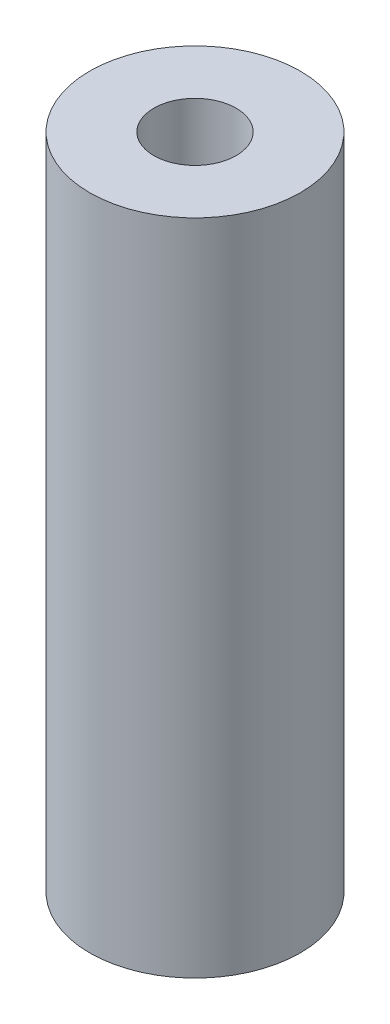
ISO-10303-21;
HEADER;
FILE_DESCRIPTION(('STEP AP214'),'2;1');
FILE_NAME('part.step','',(''),(''),'','','');
FILE_SCHEMA(('AUTOMOTIVE_DESIGN { 1 0 10303 214 1 1 1 1 }'));
ENDSEC;
DATA;
#1=APPLICATION_CONTEXT('core data for automotive mechanical design processes');
#2=APPLICATION_PROTOCOL_DEFINITION('international standard','automotive_design',2000,#1);
#3=PRODUCT_CONTEXT('',#1,'mechanical');
#4=PRODUCT('Part','Part','',(#3));
#5=PRODUCT_RELATED_PRODUCT_CATEGORY('part','',(#4));
#6=PRODUCT_DEFINITION_FORMATION('','',#4);
#7=PRODUCT_DEFINITION_CONTEXT('part definition',#1,'design');
#8=PRODUCT_DEFINITION('design','',#6,#7);
#9=PRODUCT_DEFINITION_SHAPE('','',#8);
#10=(LENGTH_UNIT() NAMED_UNIT(*) SI_UNIT(.MILLI.,.METRE.));
#11=(NAMED_UNIT(*) PLANE_ANGLE_UNIT() SI_UNIT($,.RADIAN.));
#12=(NAMED_UNIT(*) SI_UNIT($,.STERADIAN.) SOLID_ANGLE_UNIT());
#13=UNCERTAINTY_MEASURE_WITH_UNIT(LENGTH_MEASURE(1.E-05),#10,'distance_accuracy_value','');
#14=(GEOMETRIC_REPRESENTATION_CONTEXT(3) GLOBAL_UNCERTAINTY_ASSIGNED_CONTEXT((#13)) GLOBAL_UNIT_ASSIGNED_CONTEXT((#10,
#11,#12)) REPRESENTATION_CONTEXT('',''));
#15=CARTESIAN_POINT('',(0.,0.,0.));
#16=DIRECTION('',(0.,0.,1.));
#17=DIRECTION('',(1.,0.,0.));
#18=AXIS2_PLACEMENT_3D('',#15,#16,#17);
#19=CARTESIAN_POINT('',(0.,25.4,0.));
#20=DIRECTION('',(0.,1.,0.));
#21=DIRECTION('',(0.,0.,1.));
#22=AXIS2_PLACEMENT_3D('',#19,#20,#21);
#23=PLANE('',#22);
#24=CARTESIAN_POINT('',(0.,25.4,0.));
#25=DIRECTION('',(0.,1.,0.));
#26=DIRECTION('',(0.,0.,1.));
#27=AXIS2_PLACEMENT_3D('',#24,#25,#26);
#28=CIRCLE('',#27,4.064);
#29=CARTESIAN_POINT('',(0.,25.4,4.064));
#30=VERTEX_POINT('',#29);
#31=EDGE_CURVE('E10',#30,#30,#28,.T.);
#32=ORIENTED_EDGE('',*,*,#31,.T.);
#33=EDGE_LOOP('',(#32));
#34=FACE_BOUND('',#33,.T.);
#35=CARTESIAN_POINT('',(0.,25.4,0.));
#36=DIRECTION('',(0.,1.,0.));
#37=DIRECTION('',(0.,0.,1.));
#38=AXIS2_PLACEMENT_3D('',#35,#36,#37);
#39=CIRCLE('',#38,1.5875);
#40=CARTESIAN_POINT('',(0.,25.4,1.5875));
#41=VERTEX_POINT('',#40);
#42=EDGE_CURVE('E39',#41,#41,#39,.T.);
#43=ORIENTED_EDGE('',*,*,#42,.F.);
#44=EDGE_LOOP('',(#43));
#45=FACE_BOUND('',#44,.T.);
#46=ADVANCED_FACE('F28',(#34,#45),#23,.T.);
#47=CARTESIAN_POINT('',(0.,0.,0.));
#48=DIRECTION('',(0.,1.,0.));
#49=DIRECTION('',(0.,0.,1.));
#50=AXIS2_PLACEMENT_3D('',#47,#48,#49);
#51=PLANE('',#50);
#52=CARTESIAN_POINT('',(0.,0.,0.));
#53=DIRECTION('',(0.,1.,0.));
#54=DIRECTION('',(0.,0.,1.));
#55=AXIS2_PLACEMENT_3D('',#52,#53,#54);
#56=CIRCLE('',#55,4.064);
#57=CARTESIAN_POINT('',(0.,0.,4.064));
#58=VERTEX_POINT('',#57);
#59=EDGE_CURVE('E35',#58,#58,#56,.T.);
#60=ORIENTED_EDGE('',*,*,#59,.F.);
#61=EDGE_LOOP('',(#60));
#62=FACE_BOUND('',#61,.T.);
#63=CARTESIAN_POINT('',(0.,0.,0.));
#64=DIRECTION('',(0.,1.,0.));
#65=DIRECTION('',(0.,0.,1.));
#66=AXIS2_PLACEMENT_3D('',#63,#64,#65);
#67=CIRCLE('',#66,1.5875);
#68=CARTESIAN_POINT('',(0.,0.,1.5875));
#69=VERTEX_POINT('',#68);
#70=EDGE_CURVE('E43',#69,#69,#67,.T.);
#71=ORIENTED_EDGE('',*,*,#70,.T.);
#72=EDGE_LOOP('',(#71));
#73=FACE_BOUND('',#72,.T.);
#74=ADVANCED_FACE('F49',(#62,#73),#51,.F.);
#75=CARTESIAN_POINT('',(0.,25.4,0.));
#76=DIRECTION('',(0.,-1.,0.));
#77=DIRECTION('',(0.,0.,-1.));
#78=AXIS2_PLACEMENT_3D('',#75,#76,#77);
#79=CYLINDRICAL_SURFACE('',#78,4.064);
#80=ORIENTED_EDGE('',*,*,#31,.F.);
#81=EDGE_LOOP('',(#80));
#82=FACE_BOUND('',#81,.T.);
#83=ORIENTED_EDGE('',*,*,#59,.T.);
#84=EDGE_LOOP('',(#83));
#85=FACE_BOUND('',#84,.T.);
#86=ADVANCED_FACE('F30',(#82,#85),#79,.T.);
#87=CARTESIAN_POINT('',(0.,25.4,0.));
#88=DIRECTION('',(0.,-1.,0.));
#89=DIRECTION('',(0.,0.,-1.));
#90=AXIS2_PLACEMENT_3D('',#87,#88,#89);
#91=CYLINDRICAL_SURFACE('',#90,1.5875);
#92=ORIENTED_EDGE('',*,*,#42,.T.);
#93=EDGE_LOOP('',(#92));
#94=FACE_BOUND('',#93,.T.);
#95=ORIENTED_EDGE('',*,*,#70,.F.);
#96=EDGE_LOOP('',(#95));
#97=FACE_BOUND('',#96,.T.);
#98=ADVANCED_FACE('F51',(#94,#97),#91,.F.);
#99=CLOSED_SHELL('',(#46,#74,#86,#98));
#100=MANIFOLD_SOLID_BREP('B2',#99);
#101=ADVANCED_BREP_SHAPE_REPRESENTATION('',(#18,#100),#14);
#102=SHAPE_DEFINITION_REPRESENTATION(#9,#101);
ENDSEC;
END-ISO-10303-21;
